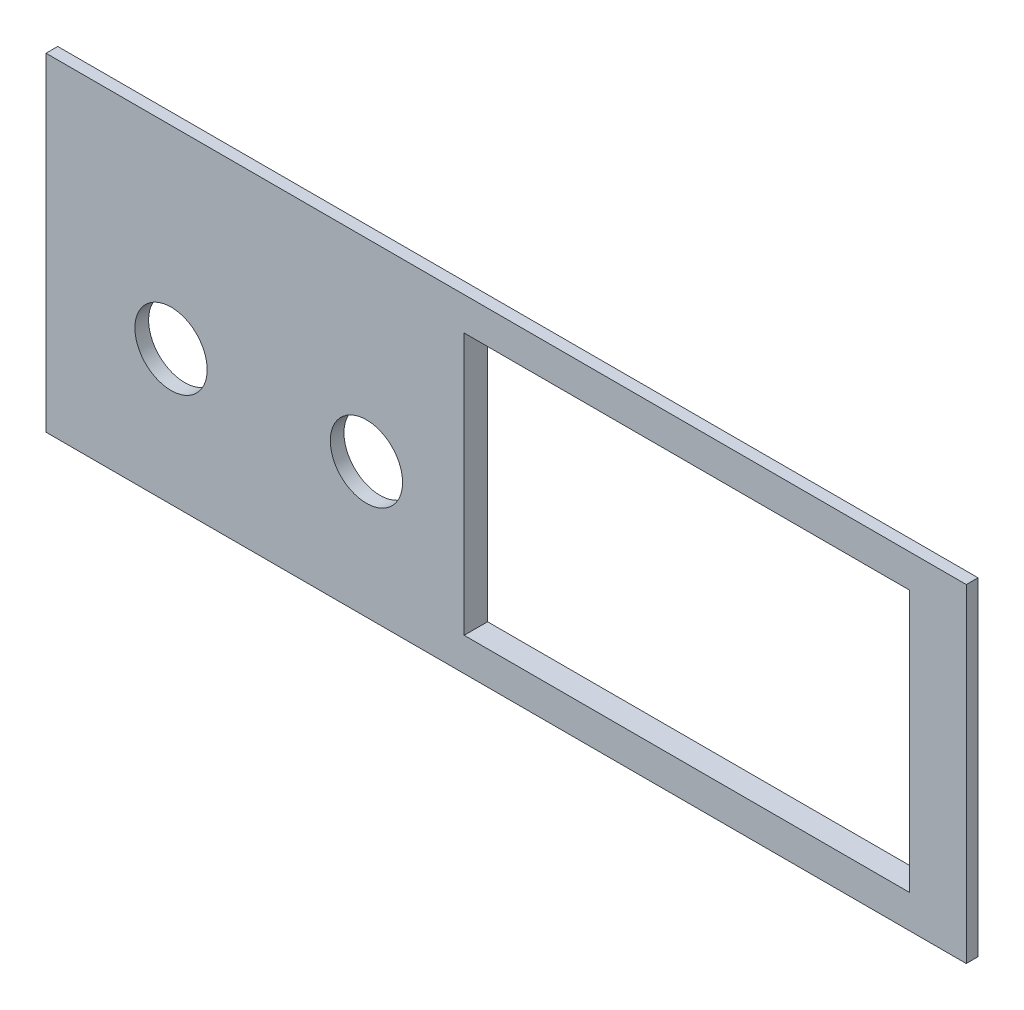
from build123d import *

# Parameters (mm, degrees)
SKETCH_1_W          = 88.6
SKETCH_1_H          = 30
EXTRUDE_1_DEPTH     = 1.2
SKETCH_2_W          = 94.2
SKETCH_2_H          = 33.6
EXTRUDE_2_DEPTH     = 1.2
SKETCH_3_R          = 3.7
SKETCH_3_W          = 45.6
SKETCH_3_H          = 26.8
CUT_EXTRUDE_2_DEPTH = 51.064058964
SKETCH_4_R          = 8
CUT_EXTRUDE_3_DEPTH = 1
CUT_EXTRUDE_4_DEPTH = 1


with BuildPart() as part:
    # Sketch 1 → Extrude 1 (new body)
    with BuildSketch(Plane.XY):
        Rectangle(SKETCH_1_W, SKETCH_1_H)
    extrude(amount=EXTRUDE_1_DEPTH)

    # Sketch 2 → Extrude 2 (add)
    with BuildSketch(Plane.XY.offset(1.2)):
        Rectangle(SKETCH_2_W, SKETCH_2_H)
    extrude(amount=EXTRUDE_2_DEPTH)

    # Sketch 3 → Cut-Extrude 2 (cut, through all)
    with BuildSketch(Plane(origin=(0, 0, 0), x_dir=(-1, 0, 0), z_dir=(0, 0, -1))):
        with Locations((14.3, -3)):
            Circle(SKETCH_3_R)
        with Locations((34.3, -3)):
            Circle(SKETCH_3_R)
        with Locations((-18.5, 0)):
            Rectangle(SKETCH_3_W, SKETCH_3_H)
    extrude(amount=-CUT_EXTRUDE_2_DEPTH, mode=Mode.SUBTRACT)

    # Sketch 4 → Cut-Extrude 3 (cut)
    with BuildSketch(Plane(origin=(0, 0, 0), x_dir=(-1, 0, 0), z_dir=(0, 0, -1))):
        with Locations((14.3, -3)):
            Circle(SKETCH_4_R)
        with Locations((34.3, -3)):
            Circle(SKETCH_4_R)
    extrude(amount=-CUT_EXTRUDE_3_DEPTH, mode=Mode.SUBTRACT)

    # Sketch 5 → Cut-Extrude 4 (cut)
    # profile 1 of 7: a face of its own
    with BuildSketch(Plane(origin=(0, 0, 0), x_dir=(-1, 0, 0), z_dir=(0, 0, -1))):
        Polygon((10.146153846, 7), (10.146153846, 10.333333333), (8.966666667, 10.333333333), (8.966666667, 11), (12.094871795, 11), (12.094871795, 10.333333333), (10.915384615, 10.333333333), (10.915384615, 7), align=None)
    # profile 2 of 7: a face of its own
    with BuildSketch(Plane(origin=(0, 0, 0), x_dir=(-1, 0, 0), z_dir=(0, 0, -1))):
        with BuildLine():
            add(Edge.make_bspline(
                [(12.453846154, 8.975961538), (12.454129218, 9.025391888), (12.454685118, 9.122466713), (12.464317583, 9.264879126), (12.477013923, 9.401386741), (12.497689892, 9.531452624), (12.52201238, 9.655685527), (12.552433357, 9.774048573), (12.589079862, 9.886126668), (12.618232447, 9.95768732), (12.632532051, 9.992788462)],
                knots=[0, 0, 0, 0, 1.141009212, 2.240794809, 3.294380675, 4.305229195, 5.280013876, 6.216333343, 7.125095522, 8, 8, 8, 8], degree=3))
            add(Edge.make_bspline(
                [(12.632532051, 9.992788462), (12.655906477, 10.042688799), (12.702380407, 10.141902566), (12.7886898, 10.282099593), (12.886516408, 10.41431675), (12.995054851, 10.537860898), (13.111534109, 10.650872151), (13.236503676, 10.747593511), (13.36552376, 10.831291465), (13.45728633, 10.87338656), (13.502724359, 10.894230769)],
                knots=[0, 0, 0, 0, 1.031372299, 2.050613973, 3.077158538, 4.108712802, 5.127684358, 6.111366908, 7.06480644, 8, 8, 8, 8], degree=3))
            add(Edge.make_bspline(
                [(13.502724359, 10.894230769), (13.533567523, 10.906881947), (13.595909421, 10.932453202), (13.692796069, 10.964367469), (13.79335887, 10.990296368), (13.89687046, 11.013473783), (14.004335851, 11.029455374), (14.114886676, 11.042855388), (14.229127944, 11.049878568), (14.306402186, 11.050809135), (14.345673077, 11.051282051)],
                knots=[0, 0, 0, 0, 0.92659354, 1.872881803, 2.832850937, 3.813025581, 4.820167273, 5.851730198, 6.908245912, 8, 8, 8, 8], degree=3))
            add(Edge.make_bspline(
                [(14.345673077, 11.051282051), (14.415990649, 11.049519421), (14.553603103, 11.046069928), (14.754616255, 11.021154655), (14.944835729, 10.979082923), (15.123617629, 10.918273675), (15.292503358, 10.842260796), (15.450180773, 10.747975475), (15.596883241, 10.636438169), (15.732327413, 10.50917841), (15.854304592, 10.366417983), (15.960536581, 10.209490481), (16.049650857, 10.039131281), (16.123041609, 9.855810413), (16.179436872, 9.658929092), (16.220182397, 9.449042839), (16.244388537, 9.225997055), (16.247248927, 9.072977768), (16.248717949, 8.994391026)],
                knots=[0, 0, 0, 0, 1.064641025, 2.083517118, 3.061799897, 4.009540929, 4.938075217, 5.861300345, 6.78508344, 7.723570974, 8.670267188, 9.622657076, 10.586935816, 11.576069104, 12.607749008, 13.683335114, 14.81022093, 16, 16, 16, 16], degree=3))
            add(Edge.make_bspline(
                [(16.248717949, 8.994391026), (16.247282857, 8.916330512), (16.244489, 8.764361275), (16.219831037, 8.543065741), (16.180774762, 8.334709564), (16.123014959, 8.139768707), (16.051814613, 7.956755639), (15.961783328, 7.787850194), (15.857776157, 7.63081195), (15.735972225, 7.489589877), (15.602807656, 7.361599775), (15.456291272, 7.251366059), (15.299761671, 7.156952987), (15.131796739, 7.080720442), (14.953491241, 7.02116354), (14.764263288, 6.978768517), (14.564015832, 6.953949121), (14.426939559, 6.950487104), (14.356891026, 6.948717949)],
                knots=[0, 0, 0, 0, 1.18845052, 2.313691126, 3.386664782, 4.412527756, 5.405809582, 6.372003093, 7.321919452, 8.268293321, 9.206237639, 10.129603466, 11.054616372, 11.9847576, 12.932764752, 13.912672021, 14.933336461, 16, 16, 16, 16], degree=3))
            add(Edge.make_bspline(
                [(14.356891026, 6.948717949), (14.286042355, 6.950491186), (14.147371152, 6.953961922), (13.94498787, 6.97870577), (13.753881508, 7.021114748), (13.574188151, 7.080881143), (13.404682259, 7.155955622), (13.246928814, 7.249403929), (13.100840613, 7.360335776), (12.966563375, 7.486819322), (12.844834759, 7.627626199), (12.740975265, 7.783654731), (12.650939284, 7.950910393), (12.579364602, 8.131926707), (12.521922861, 8.324841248), (12.482771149, 8.530764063), (12.458065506, 8.749128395), (12.455278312, 8.898968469), (12.453846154, 8.975961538)],
                knots=[0, 0, 0, 0, 1.080878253, 2.11558926, 3.1052859, 4.062802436, 5.000434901, 5.928596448, 6.853693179, 7.793554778, 8.738606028, 9.68692032, 10.647726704, 11.63151566, 12.651483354, 13.714466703, 14.825613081, 16, 16, 16, 16], degree=3))
        make_face()
        with BuildLine():
            add(Edge.make_bspline(
                [(13.223076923, 9.002403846), (13.223845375, 8.947073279), (13.225333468, 8.839926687), (13.241183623, 8.684406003), (13.265237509, 8.539015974), (13.300612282, 8.403921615), (13.345301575, 8.279025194), (13.400055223, 8.164222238), (13.46464695, 8.059341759), (13.540747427, 7.966597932), (13.623082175, 7.883795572), (13.71195519, 7.812150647), (13.805710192, 7.750485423), (13.905969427, 7.701800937), (14.010646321, 7.663164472), (14.12055414, 7.634516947), (14.236239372, 7.618786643), (14.315179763, 7.616530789), (14.355288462, 7.615384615)],
                knots=[0, 0, 0, 0, 1.313550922, 2.543666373, 3.708465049, 4.810029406, 5.85539231, 6.85404609, 7.825601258, 8.772642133, 9.696587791, 10.59409323, 11.479048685, 12.35559886, 13.234601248, 14.125357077, 15.047515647, 16, 16, 16, 16], degree=3))
            add(Edge.make_bspline(
                [(14.355288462, 7.615384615), (14.395402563, 7.616507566), (14.474353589, 7.618717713), (14.589896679, 7.634769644), (14.700022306, 7.662189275), (14.804283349, 7.700627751), (14.903155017, 7.750085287), (14.99655119, 7.810368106), (15.08393351, 7.882338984), (15.166178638, 7.963938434), (15.240224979, 8.057298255), (15.30426676, 8.162160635), (15.358993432, 8.277659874), (15.40368743, 8.403839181), (15.438191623, 8.540935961), (15.461263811, 8.689022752), (15.477242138, 8.847676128), (15.478724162, 8.957222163), (15.479487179, 9.013621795)],
                knots=[0, 0, 0, 0, 0.949153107, 1.868086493, 2.754172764, 3.630100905, 4.492260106, 5.365378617, 6.254840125, 7.166615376, 8.102436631, 9.067266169, 10.06813181, 11.121736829, 12.23011542, 13.408501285, 14.665770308, 16, 16, 16, 16], degree=3))
            add(Edge.make_bspline(
                [(15.479487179, 9.013621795), (15.478625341, 9.069476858), (15.476956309, 9.177645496), (15.462420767, 9.334296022), (15.438614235, 9.480035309), (15.405520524, 9.614825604), (15.361785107, 9.738688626), (15.309548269, 9.85196309), (15.246386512, 9.954057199), (15.173947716, 10.044918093), (15.093790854, 10.124893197), (15.007277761, 10.194907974), (14.913916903, 10.253164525), (14.814619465, 10.302179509), (14.708351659, 10.338543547), (14.596193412, 10.36506717), (14.477827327, 10.381400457), (14.396740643, 10.383527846), (14.355288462, 10.384615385)],
                knots=[0, 0, 0, 0, 1.332337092, 2.580197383, 3.749299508, 4.852775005, 5.886662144, 6.878700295, 7.822989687, 8.743523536, 9.644687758, 10.519443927, 11.392806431, 12.264866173, 13.155606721, 14.065961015, 15.011303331, 16, 16, 16, 16], degree=3))
            add(Edge.make_bspline(
                [(14.355288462, 10.384615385), (14.313831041, 10.383544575), (14.232734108, 10.38144991), (14.114183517, 10.364846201), (14.001671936, 10.339112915), (13.895419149, 10.300672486), (13.795256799, 10.252128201), (13.701555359, 10.191923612), (13.613576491, 10.122027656), (13.532701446, 10.040839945), (13.459088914, 9.949183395), (13.395896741, 9.845841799), (13.342011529, 9.731943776), (13.297801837, 9.607152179), (13.265028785, 9.471123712), (13.239839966, 9.32477257), (13.225694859, 9.16721295), (13.223968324, 9.058520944), (13.223076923, 9.002403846)],
                knots=[0, 0, 0, 0, 0.981996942, 1.920933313, 2.83127778, 3.712125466, 4.592427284, 5.463259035, 6.34592384, 7.249932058, 8.173122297, 9.125107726, 10.113123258, 11.154048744, 12.256187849, 13.424658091, 14.670364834, 16, 16, 16, 16], degree=3))
        make_face(mode=Mode.SUBTRACT)
    # profile 3 of 7: a face of its own
    with BuildSketch(Plane(origin=(0, 0, 0), x_dir=(-1, 0, 0), z_dir=(0, 0, -1))):
        with BuildLine():
            Line((16.915384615, 11), (17.684615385, 11))
            Line((17.684615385, 11), (17.684615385, 9.307692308))
            add(Edge.make_bspline(
                [(17.684615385, 9.307692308), (17.706819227, 9.31011704), (17.749501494, 9.314778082), (17.810692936, 9.325470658), (17.866662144, 9.337499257), (17.916425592, 9.354093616), (17.961108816, 9.371196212), (18.000020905, 9.392032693), (18.032766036, 9.416216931), (18.062530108, 9.443617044), (18.089600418, 9.479630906), (18.119029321, 9.525551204), (18.151939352, 9.58360011), (18.187165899, 9.654171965), (18.228023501, 9.735827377), (18.269598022, 9.830796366), (18.316458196, 9.937084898), (18.347697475, 10.012486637), (18.364102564, 10.052083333)],
                knots=[0, 0, 0, 0, 0.983135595, 1.889873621, 2.734301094, 3.500415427, 4.197038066, 4.839007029, 5.43645474, 5.985532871, 6.613673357, 7.412831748, 8.387206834, 9.549540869, 10.885422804, 12.406645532, 14.112975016, 16, 16, 16, 16], degree=3))
            add(Edge.make_bspline(
                [(18.364102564, 10.052083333), (18.385321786, 10.1027464), (18.42597344, 10.199806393), (18.490870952, 10.336204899), (18.555750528, 10.457672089), (18.620230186, 10.564500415), (18.684923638, 10.656458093), (18.749812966, 10.733127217), (18.814533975, 10.795690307), (18.861246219, 10.827232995), (18.883333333, 10.842147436)],
                knots=[0, 0, 0, 0, 1.374962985, 2.634145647, 3.779938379, 4.821222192, 5.756335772, 6.5911322, 7.333840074, 8, 8, 8, 8], degree=3))
            add(Edge.make_bspline(
                [(18.883333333, 10.842147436), (18.906358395, 10.854598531), (18.954483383, 10.880622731), (19.034420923, 10.9126014), (19.124593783, 10.938188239), (19.223966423, 10.961019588), (19.333565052, 10.977288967), (19.452828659, 10.989105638), (19.581962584, 10.996337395), (19.671251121, 10.997166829), (19.717467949, 10.997596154)],
                knots=[0, 0, 0, 0, 0.732158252, 1.530293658, 2.403065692, 3.353289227, 4.381922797, 5.501311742, 6.706648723, 8, 8, 8, 8], degree=3))
            add(Edge.make_bspline(
                [(19.717467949, 10.997596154), (19.723611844, 10.997550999), (19.73830794, 10.997442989), (19.764471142, 10.998631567), (19.798663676, 10.999239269), (19.824305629, 10.999729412), (19.838461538, 11)],
                knots=[0, 0, 0, 0, 0.609123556, 1.457013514, 2.596117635, 4, 4, 4, 4], degree=3))
            Line((19.838461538, 11), (19.838461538, 10.435897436))
            Line((19.838461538, 10.435897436), (19.723076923, 10.439102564))
            add(Edge.make_bspline(
                [(19.723076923, 10.439102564), (19.684051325, 10.438367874), (19.61142419, 10.437000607), (19.510975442, 10.426431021), (19.426843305, 10.408072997), (19.358043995, 10.380130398), (19.300291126, 10.344556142), (19.251521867, 10.299821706), (19.205482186, 10.249692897), (19.174102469, 10.198906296), (19.148355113, 10.152358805), (19.128186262, 10.10805432), (19.104444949, 10.056031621), (19.080397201, 9.994834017), (19.05181147, 9.926357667), (19.022459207, 9.84893555), (18.990294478, 9.763603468), (18.968966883, 9.703563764), (18.957852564, 9.672275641)],
                knots=[0, 0, 0, 0, 1.557134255, 2.897846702, 4.025139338, 4.981191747, 5.847793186, 6.716162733, 7.614626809, 8.554801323, 9.089031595, 9.737484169, 10.496151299, 11.371038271, 12.360724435, 13.457364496, 14.674971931, 16, 16, 16, 16], degree=3))
            add(Edge.make_bspline(
                [(18.957852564, 9.672275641), (18.945674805, 9.639006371), (18.922065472, 9.574506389), (18.88177177, 9.483612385), (18.841087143, 9.400730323), (18.79807925, 9.324241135), (18.745530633, 9.251978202), (18.674740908, 9.186293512), (18.589550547, 9.120647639), (18.524322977, 9.082584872), (18.489903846, 9.0625)],
                knots=[0, 0, 0, 0, 1.074441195, 2.083046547, 3.01428923, 3.874552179, 4.743131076, 5.711523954, 6.792422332, 8, 8, 8, 8], degree=3))
            add(Edge.make_bspline(
                [(18.489903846, 9.0625), (18.53438977, 9.048066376), (18.622353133, 9.019526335), (18.742309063, 8.948694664), (18.851448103, 8.860832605), (18.930060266, 8.769991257), (18.989561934, 8.688751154), (19.036113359, 8.621437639), (19.083340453, 8.548024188), (19.132568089, 8.469183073), (19.180591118, 8.382734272), (19.232702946, 8.292011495), (19.283305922, 8.19384451), (19.317650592, 8.126612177), (19.33525641, 8.092147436)],
                knots=[0, 0, 0, 0, 1.265105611, 2.501531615, 3.752893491, 5.051186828, 5.745218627, 6.48472037, 7.27040079, 8.112815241, 9.005089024, 9.952201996, 10.950254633, 12, 12, 12, 12], degree=3))
            Line((19.33525641, 8.092147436), (19.88974359, 7))
            Line((19.88974359, 7), (18.918589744, 7))
            Line((18.918589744, 7), (18.412980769, 8.016025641))
            add(Edge.make_bspline(
                [(18.412980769, 8.016025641), (18.410569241, 8.020294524), (18.404687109, 8.030707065), (18.394562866, 8.04920207), (18.379799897, 8.071916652), (18.369637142, 8.089164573), (18.364102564, 8.098557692)],
                knots=[0, 0, 0, 0, 0.613319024, 1.495990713, 2.636330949, 4, 4, 4, 4], degree=3))
            add(Edge.make_bspline(
                [(18.364102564, 8.098557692), (18.360040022, 8.105203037), (18.348370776, 8.124291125), (18.328039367, 8.163610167), (18.296660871, 8.220401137), (18.273198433, 8.264906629), (18.259935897, 8.290064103)],
                knots=[0, 0, 0, 0, 0.4285907, 1.231083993, 2.434823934, 4, 4, 4, 4], degree=3))
            add(Edge.make_bspline(
                [(18.259935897, 8.290064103), (18.246868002, 8.313844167), (18.221818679, 8.359427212), (18.185536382, 8.424745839), (18.149213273, 8.481991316), (18.115885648, 8.532927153), (18.083761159, 8.576020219), (18.054097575, 8.612911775), (18.025553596, 8.64228133), (17.989636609, 8.673505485), (17.937496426, 8.701961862), (17.865002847, 8.725466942), (17.779237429, 8.740629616), (17.717537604, 8.742559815), (17.684615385, 8.743589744)],
                knots=[0, 0, 0, 0, 1.239753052, 2.37643263, 3.412506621, 4.336447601, 5.156478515, 5.867379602, 6.497323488, 7.02543076, 8.036482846, 9.182555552, 10.496648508, 12, 12, 12, 12], degree=3))
            Line((17.684615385, 8.743589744), (17.684615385, 7))
            Line((17.684615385, 7), (16.915384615, 7))
            Line((16.915384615, 7), (16.915384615, 11))
        make_face()
    # profile 4 of 7: a face of its own
    with BuildSketch(Plane(origin=(0, 0, 0), x_dir=(-1, 0, 0), z_dir=(0, 0, -1))):
        with BuildLine():
            Line((38.71025641, 7), (38.71025641, 11))
            Line((38.71025641, 11), (39.989903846, 11))
            add(Edge.make_bspline(
                [(39.989903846, 11), (40.047865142, 10.999936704), (40.158723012, 10.999815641), (40.316855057, 10.996452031), (40.459229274, 10.99169047), (40.585634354, 10.985760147), (40.696515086, 10.976910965), (40.79137407, 10.966663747), (40.870808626, 10.955640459), (40.917585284, 10.94423283), (40.938621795, 10.939102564)],
                knots=[0, 0, 0, 0, 1.460485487, 2.793352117, 3.985295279, 5.050041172, 5.981765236, 6.787433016, 7.454681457, 8, 8, 8, 8], degree=3))
            add(Edge.make_bspline(
                [(40.938621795, 10.939102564), (40.966595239, 10.931126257), (41.022115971, 10.915295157), (41.101659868, 10.881545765), (41.178327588, 10.842432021), (41.251155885, 10.795815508), (41.320392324, 10.742523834), (41.386242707, 10.6829916), (41.449058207, 10.616950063), (41.50796985, 10.544529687), (41.561925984, 10.466095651), (41.608557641, 10.381531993), (41.64762522, 10.291206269), (41.680910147, 10.195797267), (41.705467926, 10.094282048), (41.722653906, 9.987365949), (41.734617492, 9.875002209), (41.735464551, 9.79810963), (41.735897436, 9.758814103)],
                knots=[0, 0, 0, 0, 0.907145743, 1.80047177, 2.69161667, 3.591261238, 4.495029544, 5.415863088, 6.359363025, 7.337192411, 8.326890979, 9.326929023, 10.346104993, 11.395420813, 12.477187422, 13.601053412, 14.774031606, 16, 16, 16, 16], degree=3))
            add(Edge.make_bspline(
                [(41.735897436, 9.758814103), (41.734662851, 9.699139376), (41.732286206, 9.584262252), (41.705695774, 9.41957197), (41.665138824, 9.269138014), (41.60586191, 9.134409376), (41.533591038, 9.014857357), (41.453983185, 8.907081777), (41.363082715, 8.814331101), (41.264872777, 8.735108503), (41.161082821, 8.670276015), (41.057104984, 8.61500724), (40.951536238, 8.572514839), (40.879559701, 8.554000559), (40.844070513, 8.544871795)],
                knots=[0, 0, 0, 0, 1.312386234, 2.526415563, 3.661883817, 4.733421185, 5.753802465, 6.732107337, 7.675884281, 8.604170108, 9.50284679, 10.365392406, 11.194030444, 12, 12, 12, 12], degree=3))
            add(Edge.make_bspline(
                [(40.844070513, 8.544871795), (40.818740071, 8.540053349), (40.765346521, 8.529896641), (40.680667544, 8.519772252), (40.588108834, 8.508565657), (40.48728969, 8.501256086), (40.378332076, 8.494410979), (40.261278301, 8.491179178), (40.136295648, 8.487285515), (40.050270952, 8.48721555), (40.005929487, 8.487179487)],
                knots=[0, 0, 0, 0, 0.735353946, 1.55003838, 2.431865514, 3.394945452, 4.432993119, 5.54609699, 6.735134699, 8, 8, 8, 8], degree=3))
            Line((40.005929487, 8.487179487), (39.479487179, 8.487179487))
            Line((39.479487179, 8.487179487), (39.479487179, 7))
            Line((39.479487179, 7), (38.71025641, 7))
        make_face()
        with BuildLine():
            Line((39.479487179, 10.333333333), (39.479487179, 9.153846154))
            Line((39.479487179, 9.153846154), (39.941025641, 9.153846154))
            add(Edge.make_bspline(
                [(39.941025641, 9.153846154), (39.980826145, 9.153897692), (40.056969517, 9.153996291), (40.166218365, 9.157535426), (40.265110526, 9.161855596), (40.353852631, 9.169006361), (40.43190901, 9.178430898), (40.499802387, 9.189703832), (40.55761189, 9.201800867), (40.620124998, 9.221847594), (40.686964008, 9.254281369), (40.758340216, 9.300896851), (40.821044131, 9.356631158), (40.873222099, 9.422089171), (40.914900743, 9.494816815), (40.944742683, 9.574068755), (40.964011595, 9.658531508), (40.965771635, 9.717041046), (40.966666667, 9.746794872)],
                knots=[0, 0, 0, 0, 1.411705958, 2.700771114, 3.876961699, 4.922619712, 5.858038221, 6.66485904, 7.363650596, 7.950905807, 8.989198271, 9.987739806, 10.967313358, 11.951275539, 12.944273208, 13.927870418, 14.946261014, 16, 16, 16, 16], degree=3))
            add(Edge.make_bspline(
                [(40.966666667, 9.746794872), (40.965407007, 9.783034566), (40.962964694, 9.853298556), (40.936032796, 9.953366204), (40.894479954, 10.044178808), (40.835071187, 10.122910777), (40.763306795, 10.189117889), (40.682646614, 10.244204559), (40.591368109, 10.282754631), (40.526767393, 10.297691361), (40.493910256, 10.305288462)],
                knots=[0, 0, 0, 0, 1.085904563, 2.105425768, 3.088705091, 4.068969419, 5.045188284, 6.010769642, 6.988240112, 8, 8, 8, 8], degree=3))
            add(Edge.make_bspline(
                [(40.493910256, 10.305288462), (40.47977108, 10.307549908), (40.448386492, 10.312569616), (40.39621892, 10.317808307), (40.334504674, 10.322572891), (40.263169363, 10.326484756), (40.182495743, 10.32954293), (40.092217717, 10.332222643), (39.992573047, 10.332437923), (39.922862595, 10.333026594), (39.886538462, 10.333333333)],
                knots=[0, 0, 0, 0, 0.564603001, 1.253243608, 2.066786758, 3.005752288, 4.070476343, 5.250658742, 6.567396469, 8, 8, 8, 8], degree=3))
            Line((39.886538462, 10.333333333), (39.479487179, 10.333333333))
        make_face(mode=Mode.SUBTRACT)
    # profile 5 of 7: a face of its own
    with BuildSketch(Plane(origin=(0, 0, 0), x_dir=(-1, 0, 0), z_dir=(0, 0, -1))):
        Polygon((34.71025641, 11), (37.88974359, 11), (37.88974359, 7), (37.120512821, 7), (37.120512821, 10.333333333), (35.479487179, 10.333333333), (35.479487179, 7), (34.71025641, 7), align=None)
    # profile 6 of 7: a face of its own
    with BuildSketch(Plane(origin=(0, 0, 0), x_dir=(-1, 0, 0), z_dir=(0, 0, -1))):
        Polygon((34.3, 7), (33.484294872, 7), (33.146955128, 7.923076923), (31.611698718, 7.923076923), (31.274358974, 7), (30.453846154, 7), (31.965865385, 11), (32.780769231, 11), align=None)
        Polygon((32.902564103, 8.58974359), (32.376923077, 10.025641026), (31.852884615, 8.58974359), align=None, mode=Mode.SUBTRACT)
    # profile 7 of 7: a face of its own
    with BuildSketch(Plane(origin=(0, 0, 0), x_dir=(-1, 0, 0), z_dir=(0, 0, -1))):
        Polygon((26.864102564, 7), (26.864102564, 11), (27.633333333, 11), (27.633333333, 9.41025641), (29.274358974, 9.41025641), (29.274358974, 11), (30.043589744, 11), (30.043589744, 7), (29.274358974, 7), (29.274358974, 8.743589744), (27.633333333, 8.743589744), (27.633333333, 7), align=None)
    extrude(amount=-CUT_EXTRUDE_4_DEPTH, mode=Mode.SUBTRACT)


solid = part.part
